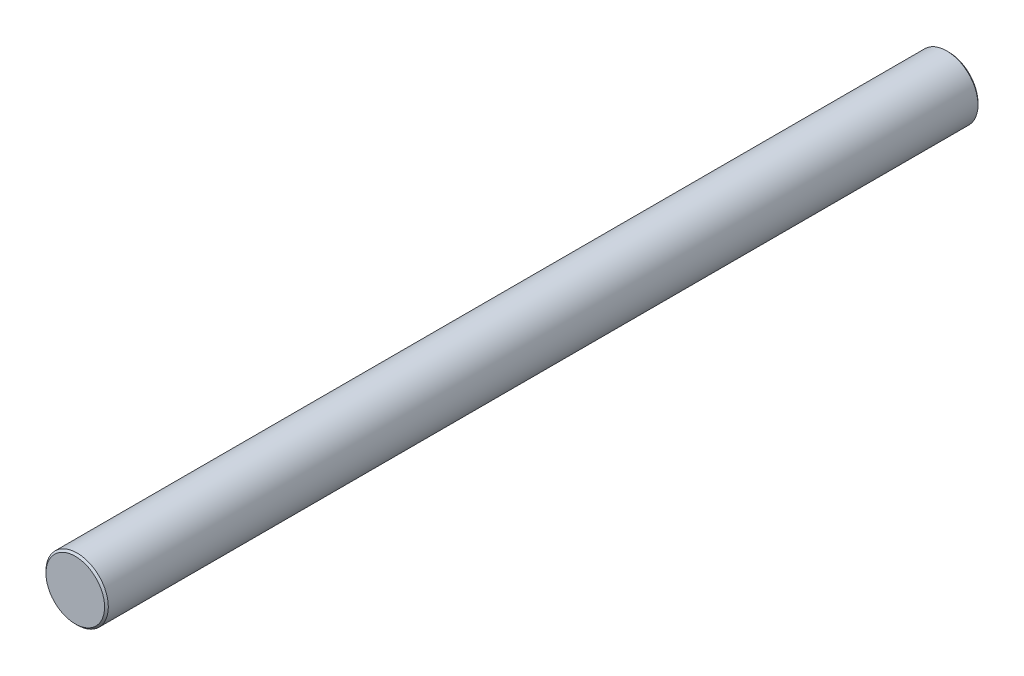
ISO-10303-21;
HEADER;
FILE_DESCRIPTION(('STEP AP214'),'2;1');
FILE_NAME('part.step','',(''),(''),'','','');
FILE_SCHEMA(('AUTOMOTIVE_DESIGN { 1 0 10303 214 1 1 1 1 }'));
ENDSEC;
DATA;
#1=APPLICATION_CONTEXT('core data for automotive mechanical design processes');
#2=APPLICATION_PROTOCOL_DEFINITION('international standard','automotive_design',2000,#1);
#3=PRODUCT_CONTEXT('',#1,'mechanical');
#4=PRODUCT('Part','Part','',(#3));
#5=PRODUCT_RELATED_PRODUCT_CATEGORY('part','',(#4));
#6=PRODUCT_DEFINITION_FORMATION('','',#4);
#7=PRODUCT_DEFINITION_CONTEXT('part definition',#1,'design');
#8=PRODUCT_DEFINITION('design','',#6,#7);
#9=PRODUCT_DEFINITION_SHAPE('','',#8);
#10=(LENGTH_UNIT() NAMED_UNIT(*) SI_UNIT(.MILLI.,.METRE.));
#11=(NAMED_UNIT(*) PLANE_ANGLE_UNIT() SI_UNIT($,.RADIAN.));
#12=(NAMED_UNIT(*) SI_UNIT($,.STERADIAN.) SOLID_ANGLE_UNIT());
#13=UNCERTAINTY_MEASURE_WITH_UNIT(LENGTH_MEASURE(1.E-05),#10,'distance_accuracy_value','');
#14=(GEOMETRIC_REPRESENTATION_CONTEXT(3) GLOBAL_UNCERTAINTY_ASSIGNED_CONTEXT((#13)) GLOBAL_UNIT_ASSIGNED_CONTEXT((#10,
#11,#12)) REPRESENTATION_CONTEXT('',''));
#15=CARTESIAN_POINT('',(0.,0.,0.));
#16=DIRECTION('',(0.,0.,1.));
#17=DIRECTION('',(1.,0.,0.));
#18=AXIS2_PLACEMENT_3D('',#15,#16,#17);
#19=CARTESIAN_POINT('',(0.,0.,355.6));
#20=DIRECTION('',(0.,0.,-1.));
#21=DIRECTION('',(-1.,0.,0.));
#22=AXIS2_PLACEMENT_3D('',#19,#20,#21);
#23=CYLINDRICAL_SURFACE('',#22,12.7);
#24=CARTESIAN_POINT('',(0.,0.,0.761999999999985));
#25=DIRECTION('',(0.,0.,1.));
#26=DIRECTION('',(1.,0.,0.));
#27=AXIS2_PLACEMENT_3D('',#24,#25,#26);
#28=CIRCLE('',#27,12.7);
#29=CARTESIAN_POINT('',(12.7,0.,0.761999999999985));
#30=VERTEX_POINT('',#29);
#31=EDGE_CURVE('E42',#30,#30,#28,.T.);
#32=ORIENTED_EDGE('',*,*,#31,.T.);
#33=EDGE_LOOP('',(#32));
#34=FACE_BOUND('',#33,.T.);
#35=CARTESIAN_POINT('',(0.,0.,354.838));
#36=DIRECTION('',(0.,0.,1.));
#37=DIRECTION('',(1.,0.,0.));
#38=AXIS2_PLACEMENT_3D('',#35,#36,#37);
#39=CIRCLE('',#38,12.7);
#40=CARTESIAN_POINT('',(12.7,0.,354.838));
#41=VERTEX_POINT('',#40);
#42=EDGE_CURVE('E46',#41,#41,#39,.F.);
#43=ORIENTED_EDGE('',*,*,#42,.T.);
#44=EDGE_LOOP('',(#43));
#45=FACE_BOUND('',#44,.T.);
#46=ADVANCED_FACE('F31',(#34,#45),#23,.T.);
#47=CARTESIAN_POINT('',(0.,0.,355.6));
#48=DIRECTION('',(0.,0.,1.));
#49=DIRECTION('',(1.,0.,0.));
#50=AXIS2_PLACEMENT_3D('',#47,#48,#49);
#51=PLANE('',#50);
#52=CARTESIAN_POINT('',(0.,0.,355.6));
#53=DIRECTION('',(0.,0.,1.));
#54=DIRECTION('',(1.,0.,0.));
#55=AXIS2_PLACEMENT_3D('',#52,#53,#54);
#56=CIRCLE('',#55,11.938);
#57=CARTESIAN_POINT('',(11.938,0.,355.6));
#58=VERTEX_POINT('',#57);
#59=EDGE_CURVE('E10',#58,#58,#56,.T.);
#60=ORIENTED_EDGE('',*,*,#59,.T.);
#61=EDGE_LOOP('',(#60));
#62=FACE_BOUND('',#61,.T.);
#63=ADVANCED_FACE('F62',(#62),#51,.T.);
#64=CARTESIAN_POINT('',(0.,0.,0.));
#65=DIRECTION('',(0.,0.,1.));
#66=DIRECTION('',(1.,0.,0.));
#67=AXIS2_PLACEMENT_3D('',#64,#65,#66);
#68=PLANE('',#67);
#69=CARTESIAN_POINT('',(0.,0.,0.));
#70=DIRECTION('',(0.,0.,1.));
#71=DIRECTION('',(1.,0.,0.));
#72=AXIS2_PLACEMENT_3D('',#69,#70,#71);
#73=CIRCLE('',#72,11.938);
#74=CARTESIAN_POINT('',(11.938,0.,0.));
#75=VERTEX_POINT('',#74);
#76=EDGE_CURVE('E38',#75,#75,#73,.F.);
#77=ORIENTED_EDGE('',*,*,#76,.T.);
#78=EDGE_LOOP('',(#77));
#79=FACE_BOUND('',#78,.T.);
#80=ADVANCED_FACE('F59',(#79),#68,.F.);
#81=CARTESIAN_POINT('',(0.,0.,0.761999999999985));
#82=DIRECTION('',(0.,0.,1.));
#83=DIRECTION('',(1.,0.,0.));
#84=AXIS2_PLACEMENT_3D('',#81,#82,#83);
#85=CONICAL_SURFACE('',#84,12.7,0.785398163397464);
#86=ORIENTED_EDGE('',*,*,#76,.F.);
#87=EDGE_LOOP('',(#86));
#88=FACE_BOUND('',#87,.T.);
#89=ORIENTED_EDGE('',*,*,#31,.F.);
#90=EDGE_LOOP('',(#89));
#91=FACE_BOUND('',#90,.T.);
#92=ADVANCED_FACE('F55',(#88,#91),#85,.T.);
#93=CARTESIAN_POINT('',(0.,0.,355.6));
#94=DIRECTION('',(0.,0.,-1.));
#95=DIRECTION('',(-1.,0.,0.));
#96=AXIS2_PLACEMENT_3D('',#93,#94,#95);
#97=CONICAL_SURFACE('',#96,11.938,0.785398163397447);
#98=ORIENTED_EDGE('',*,*,#42,.F.);
#99=EDGE_LOOP('',(#98));
#100=FACE_BOUND('',#99,.T.);
#101=ORIENTED_EDGE('',*,*,#59,.F.);
#102=EDGE_LOOP('',(#101));
#103=FACE_BOUND('',#102,.T.);
#104=ADVANCED_FACE('F33',(#100,#103),#97,.T.);
#105=CLOSED_SHELL('',(#46,#63,#80,#92,#104));
#106=MANIFOLD_SOLID_BREP('B2',#105);
#107=ADVANCED_BREP_SHAPE_REPRESENTATION('',(#18,#106),#14);
#108=SHAPE_DEFINITION_REPRESENTATION(#9,#107);
ENDSEC;
END-ISO-10303-21;
